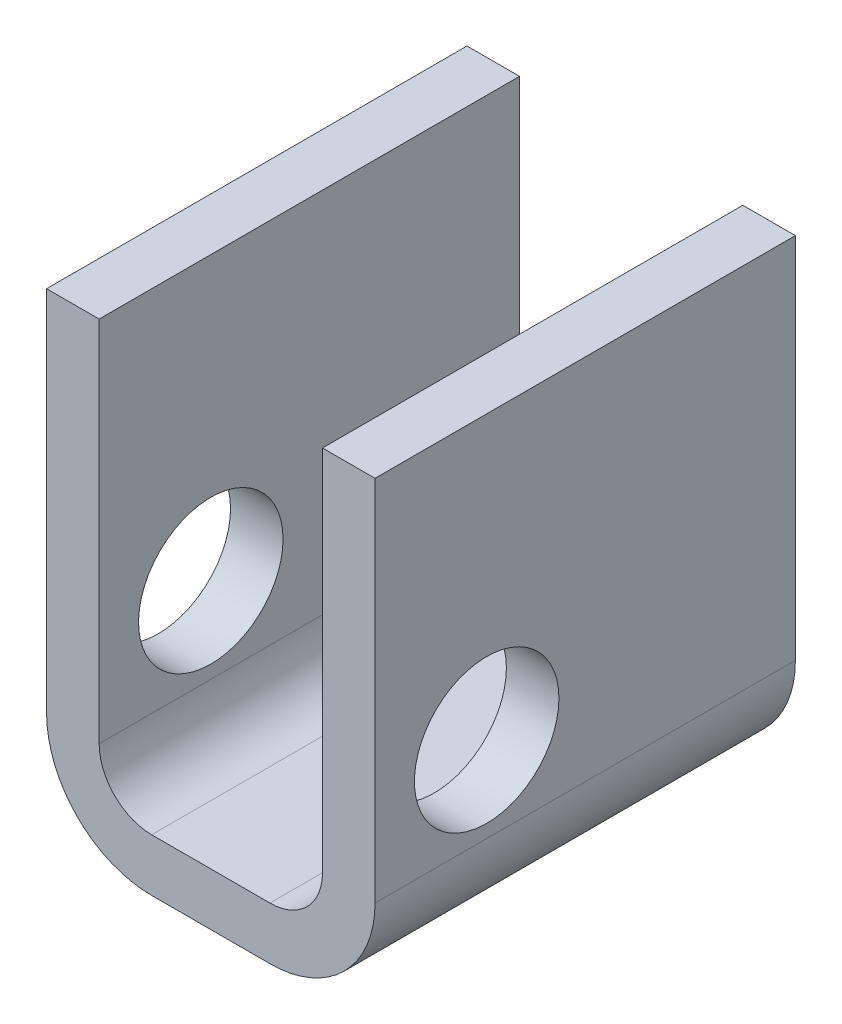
from build123d import *

# Parameters (mm, degrees)
EXTRUDE1_DEPTH = 50.8
SKETCH2_R      = 8.73125
EXTRUDE2_DEPTH = 83.075438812


with BuildPart() as part:
    # Sketch1 → Extrude1 (new body)
    with BuildSketch(Plane.XY):
        with BuildLine():
            Line((13.49375, 6.35), (13.49375, 50.8))
            Line((13.49375, 50.8), (19.84375, 50.8))
            Line((19.84375, 50.8), (19.84375, 6.35))
            ThreePointArc((19.84375, 6.35), (16.124006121, -2.630256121), (7.14375, -6.35))
            Line((7.14375, -6.35), (-7.14375, -6.35))
            ThreePointArc((-7.14375, -6.35), (-16.124006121, -2.630256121), (-19.84375, 6.35))
            Line((-19.84375, 6.35), (-19.84375, 50.8))
            Line((-19.84375, 50.8), (-13.49375, 50.8))
            Line((-13.49375, 50.8), (-13.49375, 6.35))
            ThreePointArc((-13.49375, 6.35), (-11.633878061, 1.859871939), (-7.14375, 0))
            Line((-7.14375, 0), (7.14375, 0))
            ThreePointArc((7.14375, 0), (11.633878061, 1.859871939), (13.49375, 6.35))
        make_face()
    extrude(amount=EXTRUDE1_DEPTH)

    # Sketch2 → Extrude2 (cut, through all)
    with BuildSketch(Plane(origin=(19.84375, 0, 0), x_dir=(0, 0, -1), z_dir=(1, 0, 0))):
        with Locations((-37.30625, 16.66875)):
            Circle(SKETCH2_R)
    extrude(amount=-EXTRUDE2_DEPTH, mode=Mode.SUBTRACT)


solid = part.part
